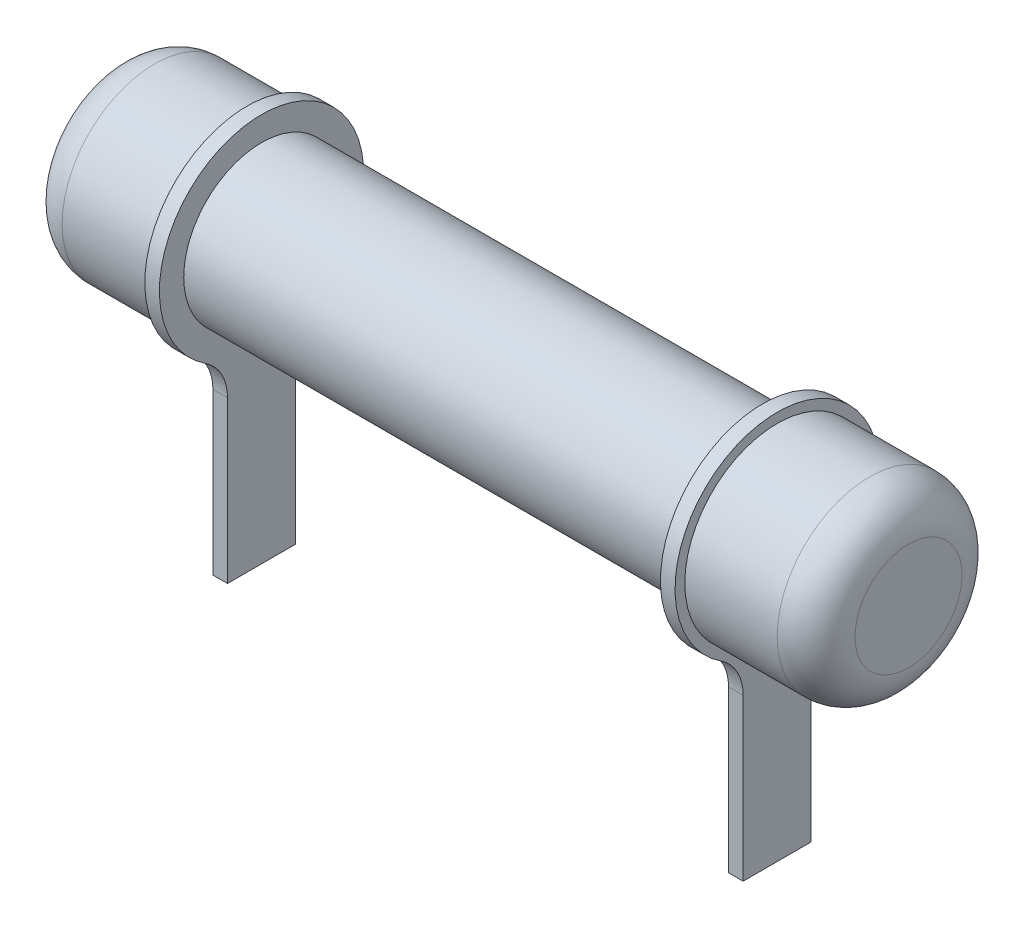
ISO-10303-21;
HEADER;
FILE_DESCRIPTION(('STEP AP214'),'2;1');
FILE_NAME('part.step','',(''),(''),'','','');
FILE_SCHEMA(('AUTOMOTIVE_DESIGN { 1 0 10303 214 1 1 1 1 }'));
ENDSEC;
DATA;
#1=APPLICATION_CONTEXT('core data for automotive mechanical design processes');
#2=APPLICATION_PROTOCOL_DEFINITION('international standard','automotive_design',2000,#1);
#3=PRODUCT_CONTEXT('',#1,'mechanical');
#4=PRODUCT('Part','Part','',(#3));
#5=PRODUCT_RELATED_PRODUCT_CATEGORY('part','',(#4));
#6=PRODUCT_DEFINITION_FORMATION('','',#4);
#7=PRODUCT_DEFINITION_CONTEXT('part definition',#1,'design');
#8=PRODUCT_DEFINITION('design','',#6,#7);
#9=PRODUCT_DEFINITION_SHAPE('','',#8);
#10=(LENGTH_UNIT() NAMED_UNIT(*) SI_UNIT(.MILLI.,.METRE.));
#11=(NAMED_UNIT(*) PLANE_ANGLE_UNIT() SI_UNIT($,.RADIAN.));
#12=(NAMED_UNIT(*) SI_UNIT($,.STERADIAN.) SOLID_ANGLE_UNIT());
#13=UNCERTAINTY_MEASURE_WITH_UNIT(LENGTH_MEASURE(1.E-05),#10,'distance_accuracy_value','');
#14=(GEOMETRIC_REPRESENTATION_CONTEXT(3) GLOBAL_UNCERTAINTY_ASSIGNED_CONTEXT((#13)) GLOBAL_UNIT_ASSIGNED_CONTEXT((#10,
#11,#12)) REPRESENTATION_CONTEXT('',''));
#15=CARTESIAN_POINT('',(0.,0.,0.));
#16=DIRECTION('',(0.,0.,1.));
#17=DIRECTION('',(1.,0.,0.));
#18=AXIS2_PLACEMENT_3D('',#15,#16,#17);
#19=CARTESIAN_POINT('',(13.3,0.,0.));
#20=DIRECTION('',(1.,0.,0.));
#21=DIRECTION('',(0.,0.,1.));
#22=AXIS2_PLACEMENT_3D('',#19,#20,#21);
#23=CYLINDRICAL_SURFACE('',#22,2.1);
#24=CARTESIAN_POINT('',(10.6,0.,0.));
#25=DIRECTION('',(-1.,0.,0.));
#26=DIRECTION('',(0.,0.,1.));
#27=AXIS2_PLACEMENT_3D('',#24,#25,#26);
#28=CIRCLE('',#27,2.1);
#29=CARTESIAN_POINT('',(10.6,-1.75607167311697,1.15161290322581));
#30=VERTEX_POINT('',#29);
#31=CARTESIAN_POINT('',(10.6,-1.75607167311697,-1.15161290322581));
#32=VERTEX_POINT('',#31);
#33=EDGE_CURVE('E185',#30,#32,#28,.T.);
#34=ORIENTED_EDGE('',*,*,#33,.T.);
#35=DIRECTION('',(1.,0.,0.));
#36=VECTOR('',#35,1.);
#37=CARTESIAN_POINT('',(13.3,-1.75607167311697,-1.15161290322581));
#38=LINE('',#37,#36);
#39=CARTESIAN_POINT('',(10.3,-1.75607167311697,-1.15161290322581));
#40=VERTEX_POINT('',#39);
#41=EDGE_CURVE('E245',#32,#40,#38,.F.);
#42=ORIENTED_EDGE('',*,*,#41,.T.);
#43=CARTESIAN_POINT('',(10.3,0.,0.));
#44=DIRECTION('',(-1.,0.,0.));
#45=DIRECTION('',(0.,0.,1.));
#46=AXIS2_PLACEMENT_3D('',#43,#44,#45);
#47=CIRCLE('',#46,2.1);
#48=CARTESIAN_POINT('',(10.3,-1.75607167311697,1.15161290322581));
#49=VERTEX_POINT('',#48);
#50=EDGE_CURVE('E166',#49,#40,#47,.T.);
#51=ORIENTED_EDGE('',*,*,#50,.F.);
#52=DIRECTION('',(1.,0.,0.));
#53=VECTOR('',#52,1.);
#54=CARTESIAN_POINT('',(13.3,-1.75607167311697,1.15161290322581));
#55=LINE('',#54,#53);
#56=EDGE_CURVE('E243',#49,#30,#55,.T.);
#57=ORIENTED_EDGE('',*,*,#56,.T.);
#58=EDGE_LOOP('',(#34,#42,#51,#57));
#59=FACE_BOUND('',#58,.T.);
#60=ADVANCED_FACE('F47',(#59),#23,.T.);
#61=CARTESIAN_POINT('',(5.75,0.,0.));
#62=DIRECTION('',(-1.,0.,0.));
#63=DIRECTION('',(0.,0.,1.));
#64=AXIS2_PLACEMENT_3D('',#61,#62,#63);
#65=CYLINDRICAL_SURFACE('',#64,1.6);
#66=CARTESIAN_POINT('',(0.,0.,0.));
#67=DIRECTION('',(-1.,0.,0.));
#68=DIRECTION('',(0.,0.,1.));
#69=AXIS2_PLACEMENT_3D('',#66,#67,#68);
#70=CIRCLE('',#69,1.6);
#71=CARTESIAN_POINT('',(0.,0.,1.6));
#72=VERTEX_POINT('',#71);
#73=EDGE_CURVE('E197',#72,#72,#70,.T.);
#74=ORIENTED_EDGE('',*,*,#73,.F.);
#75=EDGE_LOOP('',(#74));
#76=FACE_BOUND('',#75,.T.);
#77=CARTESIAN_POINT('',(10.3,0.,0.));
#78=DIRECTION('',(-1.,0.,0.));
#79=DIRECTION('',(0.,0.,1.));
#80=AXIS2_PLACEMENT_3D('',#77,#78,#79);
#81=CIRCLE('',#80,1.6);
#82=CARTESIAN_POINT('',(10.3,0.,1.6));
#83=VERTEX_POINT('',#82);
#84=EDGE_CURVE('E173',#83,#83,#81,.T.);
#85=ORIENTED_EDGE('',*,*,#84,.T.);
#86=EDGE_LOOP('',(#85));
#87=FACE_BOUND('',#86,.T.);
#88=ADVANCED_FACE('F302',(#76,#87),#65,.T.);
#89=CARTESIAN_POINT('',(-3.,0.,0.));
#90=DIRECTION('',(-1.,0.,0.));
#91=DIRECTION('',(0.,0.,1.));
#92=AXIS2_PLACEMENT_3D('',#89,#90,#91);
#93=CYLINDRICAL_SURFACE('',#92,2.1);
#94=CARTESIAN_POINT('',(0.,0.,0.));
#95=DIRECTION('',(-1.,0.,0.));
#96=DIRECTION('',(0.,0.,1.));
#97=AXIS2_PLACEMENT_3D('',#94,#95,#96);
#98=CIRCLE('',#97,2.1);
#99=CARTESIAN_POINT('',(0.,-1.75607167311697,1.15161290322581));
#100=VERTEX_POINT('',#99);
#101=CARTESIAN_POINT('',(0.,-1.75607167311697,-1.15161290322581));
#102=VERTEX_POINT('',#101);
#103=EDGE_CURVE('E215',#100,#102,#98,.T.);
#104=ORIENTED_EDGE('',*,*,#103,.T.);
#105=DIRECTION('',(-1.,0.,0.));
#106=VECTOR('',#105,1.);
#107=CARTESIAN_POINT('',(-3.,-1.75607167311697,-1.15161290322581));
#108=LINE('',#107,#106);
#109=CARTESIAN_POINT('',(-0.3,-1.75607167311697,-1.15161290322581));
#110=VERTEX_POINT('',#109);
#111=EDGE_CURVE('E251',#102,#110,#108,.T.);
#112=ORIENTED_EDGE('',*,*,#111,.T.);
#113=CARTESIAN_POINT('',(-0.3,0.,0.));
#114=DIRECTION('',(-1.,0.,0.));
#115=DIRECTION('',(0.,0.,1.));
#116=AXIS2_PLACEMENT_3D('',#113,#114,#115);
#117=CIRCLE('',#116,2.1);
#118=CARTESIAN_POINT('',(-0.3,-1.75607167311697,1.15161290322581));
#119=VERTEX_POINT('',#118);
#120=EDGE_CURVE('E234',#119,#110,#117,.T.);
#121=ORIENTED_EDGE('',*,*,#120,.F.);
#122=DIRECTION('',(-1.,0.,0.));
#123=VECTOR('',#122,1.);
#124=CARTESIAN_POINT('',(-3.,-1.75607167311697,1.15161290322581));
#125=LINE('',#124,#123);
#126=EDGE_CURVE('E248',#119,#100,#125,.F.);
#127=ORIENTED_EDGE('',*,*,#126,.T.);
#128=EDGE_LOOP('',(#104,#112,#121,#127));
#129=FACE_BOUND('',#128,.T.);
#130=ADVANCED_FACE('F49',(#129),#93,.T.);
#131=CARTESIAN_POINT('',(-0.3,2.1,0.));
#132=DIRECTION('',(1.,0.,0.));
#133=DIRECTION('',(0.,0.,-1.));
#134=AXIS2_PLACEMENT_3D('',#131,#132,#133);
#135=PLANE('',#134);
#136=DIRECTION('',(0.,1.,0.));
#137=VECTOR('',#136,1.);
#138=CARTESIAN_POINT('',(-0.3,-5.9,0.7));
#139=LINE('',#138,#137);
#140=CARTESIAN_POINT('',(-0.3,-5.9,0.7));
#141=VERTEX_POINT('',#140);
#142=CARTESIAN_POINT('',(-0.3,-2.59229627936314,0.7));
#143=VERTEX_POINT('',#142);
#144=EDGE_CURVE('E216',#141,#143,#139,.T.);
#145=ORIENTED_EDGE('',*,*,#144,.T.);
#146=CARTESIAN_POINT('',(-0.3,-2.59229627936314,1.7));
#147=DIRECTION('',(1.,0.,0.));
#148=DIRECTION('',(0.,0.,-1.));
#149=AXIS2_PLACEMENT_3D('',#146,#147,#148);
#150=CIRCLE('',#149,1.);
#151=EDGE_CURVE('E12',#143,#119,#150,.T.);
#152=ORIENTED_EDGE('',*,*,#151,.T.);
#153=ORIENTED_EDGE('',*,*,#120,.T.);
#154=CARTESIAN_POINT('',(-0.3,-2.59229627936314,-1.7));
#155=DIRECTION('',(1.,0.,0.));
#156=DIRECTION('',(0.,0.,-1.));
#157=AXIS2_PLACEMENT_3D('',#154,#155,#156);
#158=CIRCLE('',#157,1.);
#159=CARTESIAN_POINT('',(-0.3,-2.59229627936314,-0.7));
#160=VERTEX_POINT('',#159);
#161=EDGE_CURVE('E265',#110,#160,#158,.T.);
#162=ORIENTED_EDGE('',*,*,#161,.T.);
#163=DIRECTION('',(0.,1.,0.));
#164=VECTOR('',#163,1.);
#165=CARTESIAN_POINT('',(-0.3,-5.9,-0.7));
#166=LINE('',#165,#164);
#167=CARTESIAN_POINT('',(-0.3,-5.9,-0.7));
#168=VERTEX_POINT('',#167);
#169=EDGE_CURVE('E218',#168,#160,#166,.T.);
#170=ORIENTED_EDGE('',*,*,#169,.F.);
#171=DIRECTION('',(0.,0.,1.));
#172=VECTOR('',#171,1.);
#173=CARTESIAN_POINT('',(-0.3,-5.9,0.7));
#174=LINE('',#173,#172);
#175=EDGE_CURVE('E206',#168,#141,#174,.T.);
#176=ORIENTED_EDGE('',*,*,#175,.T.);
#177=EDGE_LOOP('',(#145,#152,#153,#162,#170,#176));
#178=FACE_BOUND('',#177,.T.);
#179=CARTESIAN_POINT('',(-0.3,0.,0.));
#180=DIRECTION('',(-1.,0.,0.));
#181=DIRECTION('',(0.,0.,1.));
#182=AXIS2_PLACEMENT_3D('',#179,#180,#181);
#183=CIRCLE('',#182,1.9);
#184=CARTESIAN_POINT('',(-0.3,0.,1.9));
#185=VERTEX_POINT('',#184);
#186=EDGE_CURVE('E231',#185,#185,#183,.T.);
#187=ORIENTED_EDGE('',*,*,#186,.F.);
#188=EDGE_LOOP('',(#187));
#189=FACE_BOUND('',#188,.T.);
#190=ADVANCED_FACE('F279',(#178,#189),#135,.F.);
#191=CARTESIAN_POINT('',(-3.,0.,0.));
#192=DIRECTION('',(-1.,0.,0.));
#193=DIRECTION('',(0.,0.,1.));
#194=AXIS2_PLACEMENT_3D('',#191,#192,#193);
#195=CYLINDRICAL_SURFACE('',#194,1.9);
#196=CARTESIAN_POINT('',(-2.2,0.,0.));
#197=DIRECTION('',(-1.,0.,0.));
#198=DIRECTION('',(0.,0.,1.));
#199=AXIS2_PLACEMENT_3D('',#196,#197,#198);
#200=CIRCLE('',#199,1.9);
#201=CARTESIAN_POINT('',(-2.2,0.,1.9));
#202=VERTEX_POINT('',#201);
#203=EDGE_CURVE('E228',#202,#202,#200,.T.);
#204=ORIENTED_EDGE('',*,*,#203,.F.);
#205=EDGE_LOOP('',(#204));
#206=FACE_BOUND('',#205,.T.);
#207=ORIENTED_EDGE('',*,*,#186,.T.);
#208=EDGE_LOOP('',(#207));
#209=FACE_BOUND('',#208,.T.);
#210=ADVANCED_FACE('F342',(#206,#209),#195,.T.);
#211=CARTESIAN_POINT('',(-2.2,0.,0.));
#212=DIRECTION('',(-1.,0.,0.));
#213=DIRECTION('',(0.,0.,1.));
#214=AXIS2_PLACEMENT_3D('',#211,#212,#213);
#215=TOROIDAL_SURFACE('',#214,1.1,0.8);
#216=CARTESIAN_POINT('',(-3.,0.,0.));
#217=DIRECTION('',(-1.,0.,0.));
#218=DIRECTION('',(0.,0.,1.));
#219=AXIS2_PLACEMENT_3D('',#216,#217,#218);
#220=CIRCLE('',#219,1.1);
#221=CARTESIAN_POINT('',(-3.,0.,1.1));
#222=VERTEX_POINT('',#221);
#223=EDGE_CURVE('E225',#222,#222,#220,.T.);
#224=ORIENTED_EDGE('',*,*,#223,.F.);
#225=EDGE_LOOP('',(#224));
#226=FACE_BOUND('',#225,.T.);
#227=ORIENTED_EDGE('',*,*,#203,.T.);
#228=EDGE_LOOP('',(#227));
#229=FACE_BOUND('',#228,.T.);
#230=ADVANCED_FACE('F338',(#226,#229),#215,.T.);
#231=CARTESIAN_POINT('',(-3.,1.1,0.));
#232=DIRECTION('',(1.,0.,0.));
#233=DIRECTION('',(0.,0.,-1.));
#234=AXIS2_PLACEMENT_3D('',#231,#232,#233);
#235=PLANE('',#234);
#236=ORIENTED_EDGE('',*,*,#223,.T.);
#237=EDGE_LOOP('',(#236));
#238=FACE_BOUND('',#237,.T.);
#239=ADVANCED_FACE('F332',(#238),#235,.F.);
#240=CARTESIAN_POINT('',(0.,1.6,0.));
#241=DIRECTION('',(-1.,0.,0.));
#242=DIRECTION('',(0.,0.,1.));
#243=AXIS2_PLACEMENT_3D('',#240,#241,#242);
#244=PLANE('',#243);
#245=ORIENTED_EDGE('',*,*,#103,.F.);
#246=CARTESIAN_POINT('',(0.,-2.59229627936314,1.7));
#247=DIRECTION('',(-1.,0.,0.));
#248=DIRECTION('',(0.,0.,1.));
#249=AXIS2_PLACEMENT_3D('',#246,#247,#248);
#250=CIRCLE('',#249,1.);
#251=CARTESIAN_POINT('',(0.,-2.59229627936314,0.7));
#252=VERTEX_POINT('',#251);
#253=EDGE_CURVE('E56',#100,#252,#250,.T.);
#254=ORIENTED_EDGE('',*,*,#253,.T.);
#255=DIRECTION('',(0.,1.,0.));
#256=VECTOR('',#255,1.);
#257=CARTESIAN_POINT('',(0.,-5.9,0.7));
#258=LINE('',#257,#256);
#259=CARTESIAN_POINT('',(0.,-5.9,0.7));
#260=VERTEX_POINT('',#259);
#261=EDGE_CURVE('E213',#260,#252,#258,.T.);
#262=ORIENTED_EDGE('',*,*,#261,.F.);
#263=DIRECTION('',(0.,0.,-1.));
#264=VECTOR('',#263,1.);
#265=CARTESIAN_POINT('',(0.,-5.9,0.7));
#266=LINE('',#265,#264);
#267=CARTESIAN_POINT('',(0.,-5.9,-0.7));
#268=VERTEX_POINT('',#267);
#269=EDGE_CURVE('E200',#260,#268,#266,.T.);
#270=ORIENTED_EDGE('',*,*,#269,.T.);
#271=DIRECTION('',(0.,1.,0.));
#272=VECTOR('',#271,1.);
#273=CARTESIAN_POINT('',(0.,-5.9,-0.7));
#274=LINE('',#273,#272);
#275=CARTESIAN_POINT('',(0.,-2.59229627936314,-0.7));
#276=VERTEX_POINT('',#275);
#277=EDGE_CURVE('E212',#268,#276,#274,.T.);
#278=ORIENTED_EDGE('',*,*,#277,.T.);
#279=CARTESIAN_POINT('',(0.,-2.59229627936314,-1.7));
#280=DIRECTION('',(-1.,0.,0.));
#281=DIRECTION('',(0.,0.,1.));
#282=AXIS2_PLACEMENT_3D('',#279,#280,#281);
#283=CIRCLE('',#282,1.);
#284=EDGE_CURVE('E267',#276,#102,#283,.T.);
#285=ORIENTED_EDGE('',*,*,#284,.T.);
#286=EDGE_LOOP('',(#245,#254,#262,#270,#278,#285));
#287=FACE_BOUND('',#286,.T.);
#288=ORIENTED_EDGE('',*,*,#73,.T.);
#289=EDGE_LOOP('',(#288));
#290=FACE_BOUND('',#289,.T.);
#291=ADVANCED_FACE('F269',(#287,#290),#244,.F.);
#292=CARTESIAN_POINT('',(0.,-5.9,0.7));
#293=DIRECTION('',(0.,0.,1.));
#294=DIRECTION('',(1.,0.,0.));
#295=AXIS2_PLACEMENT_3D('',#292,#293,#294);
#296=PLANE('',#295);
#297=ORIENTED_EDGE('',*,*,#261,.T.);
#298=DIRECTION('',(-1.,0.,0.));
#299=VECTOR('',#298,1.);
#300=CARTESIAN_POINT('',(0.,-2.59229627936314,0.7));
#301=LINE('',#300,#299);
#302=EDGE_CURVE('E69',#252,#143,#301,.T.);
#303=ORIENTED_EDGE('',*,*,#302,.T.);
#304=ORIENTED_EDGE('',*,*,#144,.F.);
#305=DIRECTION('',(1.,0.,0.));
#306=VECTOR('',#305,1.);
#307=CARTESIAN_POINT('',(0.,-5.9,0.7));
#308=LINE('',#307,#306);
#309=EDGE_CURVE('E209',#141,#260,#308,.T.);
#310=ORIENTED_EDGE('',*,*,#309,.T.);
#311=EDGE_LOOP('',(#297,#303,#304,#310));
#312=FACE_BOUND('',#311,.T.);
#313=ADVANCED_FACE('F289',(#312),#296,.T.);
#314=CARTESIAN_POINT('',(0.,-5.9,-0.7));
#315=DIRECTION('',(0.,0.,-1.));
#316=DIRECTION('',(-1.,0.,0.));
#317=AXIS2_PLACEMENT_3D('',#314,#315,#316);
#318=PLANE('',#317);
#319=ORIENTED_EDGE('',*,*,#169,.T.);
#320=DIRECTION('',(-1.,0.,0.));
#321=VECTOR('',#320,1.);
#322=CARTESIAN_POINT('',(0.,-2.59229627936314,-0.7));
#323=LINE('',#322,#321);
#324=EDGE_CURVE('E254',#160,#276,#323,.F.);
#325=ORIENTED_EDGE('',*,*,#324,.T.);
#326=ORIENTED_EDGE('',*,*,#277,.F.);
#327=DIRECTION('',(-1.,0.,0.));
#328=VECTOR('',#327,1.);
#329=CARTESIAN_POINT('',(0.,-5.9,-0.7));
#330=LINE('',#329,#328);
#331=EDGE_CURVE('E203',#268,#168,#330,.T.);
#332=ORIENTED_EDGE('',*,*,#331,.T.);
#333=EDGE_LOOP('',(#319,#325,#326,#332));
#334=FACE_BOUND('',#333,.T.);
#335=ADVANCED_FACE('F283',(#334),#318,.T.);
#336=CARTESIAN_POINT('',(0.,-5.9,-0.7));
#337=DIRECTION('',(0.,1.,0.));
#338=DIRECTION('',(0.,0.,1.));
#339=AXIS2_PLACEMENT_3D('',#336,#337,#338);
#340=PLANE('',#339);
#341=ORIENTED_EDGE('',*,*,#269,.F.);
#342=ORIENTED_EDGE('',*,*,#309,.F.);
#343=ORIENTED_EDGE('',*,*,#175,.F.);
#344=ORIENTED_EDGE('',*,*,#331,.F.);
#345=EDGE_LOOP('',(#341,#342,#343,#344));
#346=FACE_BOUND('',#345,.T.);
#347=ADVANCED_FACE('F287',(#346),#340,.F.);
#348=CARTESIAN_POINT('',(10.6,2.1,0.));
#349=DIRECTION('',(-1.,0.,0.));
#350=DIRECTION('',(0.,0.,-1.));
#351=AXIS2_PLACEMENT_3D('',#348,#349,#350);
#352=PLANE('',#351);
#353=ORIENTED_EDGE('',*,*,#33,.F.);
#354=CARTESIAN_POINT('',(10.6,-2.59229627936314,1.7));
#355=DIRECTION('',(-1.,0.,0.));
#356=DIRECTION('',(0.,0.,1.));
#357=AXIS2_PLACEMENT_3D('',#354,#355,#356);
#358=CIRCLE('',#357,1.);
#359=CARTESIAN_POINT('',(10.6,-2.59229627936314,0.7));
#360=VERTEX_POINT('',#359);
#361=EDGE_CURVE('E263',#30,#360,#358,.T.);
#362=ORIENTED_EDGE('',*,*,#361,.T.);
#363=DIRECTION('',(0.,1.,0.));
#364=VECTOR('',#363,1.);
#365=CARTESIAN_POINT('',(10.6,-5.9,0.7));
#366=LINE('',#365,#364);
#367=CARTESIAN_POINT('',(10.6,-5.9,0.7));
#368=VERTEX_POINT('',#367);
#369=EDGE_CURVE('E154',#368,#360,#366,.T.);
#370=ORIENTED_EDGE('',*,*,#369,.F.);
#371=DIRECTION('',(0.,0.,1.));
#372=VECTOR('',#371,1.);
#373=CARTESIAN_POINT('',(10.6,-5.9,0.7));
#374=LINE('',#373,#372);
#375=CARTESIAN_POINT('',(10.6,-5.9,-0.7));
#376=VERTEX_POINT('',#375);
#377=EDGE_CURVE('E142',#376,#368,#374,.T.);
#378=ORIENTED_EDGE('',*,*,#377,.F.);
#379=DIRECTION('',(0.,1.,0.));
#380=VECTOR('',#379,1.);
#381=CARTESIAN_POINT('',(10.6,-5.9,-0.7));
#382=LINE('',#381,#380);
#383=CARTESIAN_POINT('',(10.6,-2.59229627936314,-0.7));
#384=VERTEX_POINT('',#383);
#385=EDGE_CURVE('E167',#376,#384,#382,.T.);
#386=ORIENTED_EDGE('',*,*,#385,.T.);
#387=CARTESIAN_POINT('',(10.6,-2.59229627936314,-1.7));
#388=DIRECTION('',(-1.,0.,0.));
#389=DIRECTION('',(0.,0.,1.));
#390=AXIS2_PLACEMENT_3D('',#387,#388,#389);
#391=CIRCLE('',#390,1.);
#392=EDGE_CURVE('E257',#384,#32,#391,.T.);
#393=ORIENTED_EDGE('',*,*,#392,.T.);
#394=EDGE_LOOP('',(#353,#362,#370,#378,#386,#393));
#395=FACE_BOUND('',#394,.T.);
#396=CARTESIAN_POINT('',(10.6,0.,0.));
#397=DIRECTION('',(-1.,0.,0.));
#398=DIRECTION('',(0.,0.,1.));
#399=AXIS2_PLACEMENT_3D('',#396,#397,#398);
#400=CIRCLE('',#399,1.9);
#401=CARTESIAN_POINT('',(10.6,0.,1.9));
#402=VERTEX_POINT('',#401);
#403=EDGE_CURVE('E182',#402,#402,#400,.T.);
#404=ORIENTED_EDGE('',*,*,#403,.T.);
#405=EDGE_LOOP('',(#404));
#406=FACE_BOUND('',#405,.T.);
#407=ADVANCED_FACE('F312',(#395,#406),#352,.F.);
#408=CARTESIAN_POINT('',(13.3,0.,0.));
#409=DIRECTION('',(1.,0.,0.));
#410=DIRECTION('',(0.,0.,1.));
#411=AXIS2_PLACEMENT_3D('',#408,#409,#410);
#412=CYLINDRICAL_SURFACE('',#411,1.9);
#413=CARTESIAN_POINT('',(12.5,0.,0.));
#414=DIRECTION('',(-1.,0.,0.));
#415=DIRECTION('',(0.,0.,1.));
#416=AXIS2_PLACEMENT_3D('',#413,#414,#415);
#417=CIRCLE('',#416,1.9);
#418=CARTESIAN_POINT('',(12.5,0.,1.9));
#419=VERTEX_POINT('',#418);
#420=EDGE_CURVE('E179',#419,#419,#417,.T.);
#421=ORIENTED_EDGE('',*,*,#420,.T.);
#422=EDGE_LOOP('',(#421));
#423=FACE_BOUND('',#422,.T.);
#424=ORIENTED_EDGE('',*,*,#403,.F.);
#425=EDGE_LOOP('',(#424));
#426=FACE_BOUND('',#425,.T.);
#427=ADVANCED_FACE('F401',(#423,#426),#412,.T.);
#428=CARTESIAN_POINT('',(12.5,0.,0.));
#429=DIRECTION('',(1.,0.,0.));
#430=DIRECTION('',(0.,0.,1.));
#431=AXIS2_PLACEMENT_3D('',#428,#429,#430);
#432=TOROIDAL_SURFACE('',#431,1.1,0.8);
#433=CARTESIAN_POINT('',(13.3,0.,0.));
#434=DIRECTION('',(-1.,0.,0.));
#435=DIRECTION('',(0.,0.,1.));
#436=AXIS2_PLACEMENT_3D('',#433,#434,#435);
#437=CIRCLE('',#436,1.1);
#438=CARTESIAN_POINT('',(13.3,0.,1.1));
#439=VERTEX_POINT('',#438);
#440=EDGE_CURVE('E176',#439,#439,#437,.T.);
#441=ORIENTED_EDGE('',*,*,#440,.T.);
#442=EDGE_LOOP('',(#441));
#443=FACE_BOUND('',#442,.T.);
#444=ORIENTED_EDGE('',*,*,#420,.F.);
#445=EDGE_LOOP('',(#444));
#446=FACE_BOUND('',#445,.T.);
#447=ADVANCED_FACE('F473',(#443,#446),#432,.T.);
#448=CARTESIAN_POINT('',(13.3,1.1,0.));
#449=DIRECTION('',(-1.,0.,0.));
#450=DIRECTION('',(0.,0.,-1.));
#451=AXIS2_PLACEMENT_3D('',#448,#449,#450);
#452=PLANE('',#451);
#453=ORIENTED_EDGE('',*,*,#440,.F.);
#454=EDGE_LOOP('',(#453));
#455=FACE_BOUND('',#454,.T.);
#456=ADVANCED_FACE('F414',(#455),#452,.F.);
#457=CARTESIAN_POINT('',(10.3,1.6,0.));
#458=DIRECTION('',(1.,0.,0.));
#459=DIRECTION('',(0.,0.,1.));
#460=AXIS2_PLACEMENT_3D('',#457,#458,#459);
#461=PLANE('',#460);
#462=DIRECTION('',(0.,1.,0.));
#463=VECTOR('',#462,1.);
#464=CARTESIAN_POINT('',(10.3,-5.9,0.7));
#465=LINE('',#464,#463);
#466=CARTESIAN_POINT('',(10.3,-5.9,0.7));
#467=VERTEX_POINT('',#466);
#468=CARTESIAN_POINT('',(10.3,-2.59229627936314,0.7));
#469=VERTEX_POINT('',#468);
#470=EDGE_CURVE('E149',#467,#469,#465,.T.);
#471=ORIENTED_EDGE('',*,*,#470,.T.);
#472=CARTESIAN_POINT('',(10.3,-2.59229627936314,1.7));
#473=DIRECTION('',(1.,0.,0.));
#474=DIRECTION('',(0.,0.,-1.));
#475=AXIS2_PLACEMENT_3D('',#472,#473,#474);
#476=CIRCLE('',#475,1.);
#477=EDGE_CURVE('E261',#469,#49,#476,.T.);
#478=ORIENTED_EDGE('',*,*,#477,.T.);
#479=ORIENTED_EDGE('',*,*,#50,.T.);
#480=CARTESIAN_POINT('',(10.3,-2.59229627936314,-1.7));
#481=DIRECTION('',(1.,0.,0.));
#482=DIRECTION('',(0.,0.,-1.));
#483=AXIS2_PLACEMENT_3D('',#480,#481,#482);
#484=CIRCLE('',#483,1.);
#485=CARTESIAN_POINT('',(10.3,-2.59229627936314,-0.7));
#486=VERTEX_POINT('',#485);
#487=EDGE_CURVE('E259',#40,#486,#484,.T.);
#488=ORIENTED_EDGE('',*,*,#487,.T.);
#489=DIRECTION('',(0.,1.,0.));
#490=VECTOR('',#489,1.);
#491=CARTESIAN_POINT('',(10.3,-5.9,-0.7));
#492=LINE('',#491,#490);
#493=CARTESIAN_POINT('',(10.3,-5.9,-0.7));
#494=VERTEX_POINT('',#493);
#495=EDGE_CURVE('E160',#494,#486,#492,.T.);
#496=ORIENTED_EDGE('',*,*,#495,.F.);
#497=DIRECTION('',(0.,0.,-1.));
#498=VECTOR('',#497,1.);
#499=CARTESIAN_POINT('',(10.3,-5.9,0.7));
#500=LINE('',#499,#498);
#501=EDGE_CURVE('E139',#467,#494,#500,.T.);
#502=ORIENTED_EDGE('',*,*,#501,.F.);
#503=EDGE_LOOP('',(#471,#478,#479,#488,#496,#502));
#504=FACE_BOUND('',#503,.T.);
#505=ORIENTED_EDGE('',*,*,#84,.F.);
#506=EDGE_LOOP('',(#505));
#507=FACE_BOUND('',#506,.T.);
#508=ADVANCED_FACE('F157',(#504,#507),#461,.F.);
#509=CARTESIAN_POINT('',(10.3,-5.9,-0.7));
#510=DIRECTION('',(0.,0.,1.));
#511=DIRECTION('',(1.,0.,0.));
#512=AXIS2_PLACEMENT_3D('',#509,#510,#511);
#513=PLANE('',#512);
#514=ORIENTED_EDGE('',*,*,#495,.T.);
#515=DIRECTION('',(-1.,0.,0.));
#516=VECTOR('',#515,1.);
#517=CARTESIAN_POINT('',(10.6,-2.59229627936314,-0.7));
#518=LINE('',#517,#516);
#519=EDGE_CURVE('E240',#486,#384,#518,.F.);
#520=ORIENTED_EDGE('',*,*,#519,.T.);
#521=ORIENTED_EDGE('',*,*,#385,.F.);
#522=DIRECTION('',(1.,0.,0.));
#523=VECTOR('',#522,1.);
#524=CARTESIAN_POINT('',(10.3,-5.9,-0.7));
#525=LINE('',#524,#523);
#526=EDGE_CURVE('E155',#494,#376,#525,.T.);
#527=ORIENTED_EDGE('',*,*,#526,.F.);
#528=EDGE_LOOP('',(#514,#520,#521,#527));
#529=FACE_BOUND('',#528,.T.);
#530=ADVANCED_FACE('F413',(#529),#513,.F.);
#531=CARTESIAN_POINT('',(10.3,-5.9,0.7));
#532=DIRECTION('',(0.,0.,-1.));
#533=DIRECTION('',(-1.,0.,0.));
#534=AXIS2_PLACEMENT_3D('',#531,#532,#533);
#535=PLANE('',#534);
#536=ORIENTED_EDGE('',*,*,#369,.T.);
#537=DIRECTION('',(-1.,0.,0.));
#538=VECTOR('',#537,1.);
#539=CARTESIAN_POINT('',(10.3,-2.59229627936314,0.7));
#540=LINE('',#539,#538);
#541=EDGE_CURVE('E152',#360,#469,#540,.T.);
#542=ORIENTED_EDGE('',*,*,#541,.T.);
#543=ORIENTED_EDGE('',*,*,#470,.F.);
#544=DIRECTION('',(-1.,0.,0.));
#545=VECTOR('',#544,1.);
#546=CARTESIAN_POINT('',(10.3,-5.9,0.7));
#547=LINE('',#546,#545);
#548=EDGE_CURVE('E135',#368,#467,#547,.T.);
#549=ORIENTED_EDGE('',*,*,#548,.F.);
#550=EDGE_LOOP('',(#536,#542,#543,#549));
#551=FACE_BOUND('',#550,.T.);
#552=ADVANCED_FACE('F150',(#551),#535,.F.);
#553=CARTESIAN_POINT('',(10.3,-5.9,-0.7));
#554=DIRECTION('',(0.,1.,0.));
#555=DIRECTION('',(0.,0.,1.));
#556=AXIS2_PLACEMENT_3D('',#553,#554,#555);
#557=PLANE('',#556);
#558=ORIENTED_EDGE('',*,*,#501,.T.);
#559=ORIENTED_EDGE('',*,*,#526,.T.);
#560=ORIENTED_EDGE('',*,*,#377,.T.);
#561=ORIENTED_EDGE('',*,*,#548,.T.);
#562=EDGE_LOOP('',(#558,#559,#560,#561));
#563=FACE_BOUND('',#562,.T.);
#564=ADVANCED_FACE('F137',(#563),#557,.F.);
#565=CARTESIAN_POINT('',(13.3,-2.59229627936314,-1.7));
#566=DIRECTION('',(1.,0.,0.));
#567=DIRECTION('',(0.,0.,-1.));
#568=AXIS2_PLACEMENT_3D('',#565,#566,#567);
#569=CYLINDRICAL_SURFACE('',#568,1.);
#570=ORIENTED_EDGE('',*,*,#487,.F.);
#571=ORIENTED_EDGE('',*,*,#41,.F.);
#572=ORIENTED_EDGE('',*,*,#392,.F.);
#573=ORIENTED_EDGE('',*,*,#519,.F.);
#574=EDGE_LOOP('',(#570,#571,#572,#573));
#575=FACE_BOUND('',#574,.T.);
#576=ADVANCED_FACE('F438',(#575),#569,.F.);
#577=CARTESIAN_POINT('',(13.3,-2.59229627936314,1.7));
#578=DIRECTION('',(1.,0.,0.));
#579=DIRECTION('',(0.,0.,-1.));
#580=AXIS2_PLACEMENT_3D('',#577,#578,#579);
#581=CYLINDRICAL_SURFACE('',#580,1.);
#582=ORIENTED_EDGE('',*,*,#361,.F.);
#583=ORIENTED_EDGE('',*,*,#56,.F.);
#584=ORIENTED_EDGE('',*,*,#477,.F.);
#585=ORIENTED_EDGE('',*,*,#541,.F.);
#586=EDGE_LOOP('',(#582,#583,#584,#585));
#587=FACE_BOUND('',#586,.T.);
#588=ADVANCED_FACE('F299',(#587),#581,.F.);
#589=CARTESIAN_POINT('',(-3.,-2.59229627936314,-1.7));
#590=DIRECTION('',(-1.,0.,0.));
#591=DIRECTION('',(0.,0.,1.));
#592=AXIS2_PLACEMENT_3D('',#589,#590,#591);
#593=CYLINDRICAL_SURFACE('',#592,1.);
#594=ORIENTED_EDGE('',*,*,#284,.F.);
#595=ORIENTED_EDGE('',*,*,#324,.F.);
#596=ORIENTED_EDGE('',*,*,#161,.F.);
#597=ORIENTED_EDGE('',*,*,#111,.F.);
#598=EDGE_LOOP('',(#594,#595,#596,#597));
#599=FACE_BOUND('',#598,.T.);
#600=ADVANCED_FACE('F277',(#599),#593,.F.);
#601=CARTESIAN_POINT('',(-3.,-2.59229627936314,1.7));
#602=DIRECTION('',(-1.,0.,0.));
#603=DIRECTION('',(0.,0.,1.));
#604=AXIS2_PLACEMENT_3D('',#601,#602,#603);
#605=CYLINDRICAL_SURFACE('',#604,1.);
#606=ORIENTED_EDGE('',*,*,#151,.F.);
#607=ORIENTED_EDGE('',*,*,#302,.F.);
#608=ORIENTED_EDGE('',*,*,#253,.F.);
#609=ORIENTED_EDGE('',*,*,#126,.F.);
#610=EDGE_LOOP('',(#606,#607,#608,#609));
#611=FACE_BOUND('',#610,.T.);
#612=ADVANCED_FACE('F292',(#611),#605,.F.);
#613=CLOSED_SHELL('',(#60,#88,#130,#190,#210,#230,#239,#291,#313,#335,#347,#407,#427,#447,#456,
#508,#530,#552,#564,#576,#588,#600,#612));
#614=CARTESIAN_POINT('',(5.75,0.,0.));
#615=DIRECTION('',(-1.,0.,0.));
#616=DIRECTION('',(0.,0.,1.));
#617=AXIS2_PLACEMENT_3D('',#614,#615,#616);
#618=CYLINDRICAL_SURFACE('',#617,0.15);
#619=CARTESIAN_POINT('',(-2.,0.,0.));
#620=DIRECTION('',(-1.,0.,0.));
#621=DIRECTION('',(0.,0.,1.));
#622=AXIS2_PLACEMENT_3D('',#619,#620,#621);
#623=CIRCLE('',#622,0.15);
#624=CARTESIAN_POINT('',(-2.,0.,0.15));
#625=VERTEX_POINT('',#624);
#626=EDGE_CURVE('E237',#625,#625,#623,.F.);
#627=ORIENTED_EDGE('',*,*,#626,.T.);
#628=EDGE_LOOP('',(#627));
#629=FACE_BOUND('',#628,.T.);
#630=CARTESIAN_POINT('',(12.3,0.,0.));
#631=DIRECTION('',(1.,0.,0.));
#632=DIRECTION('',(0.,0.,-1.));
#633=AXIS2_PLACEMENT_3D('',#630,#631,#632);
#634=CIRCLE('',#633,0.15);
#635=CARTESIAN_POINT('',(12.3,0.,-0.15));
#636=VERTEX_POINT('',#635);
#637=EDGE_CURVE('E191',#636,#636,#634,.T.);
#638=ORIENTED_EDGE('',*,*,#637,.F.);
#639=EDGE_LOOP('',(#638));
#640=FACE_BOUND('',#639,.T.);
#641=ADVANCED_FACE('F314',(#629,#640),#618,.T.);
#642=CARTESIAN_POINT('',(-2.,1.6,0.));
#643=DIRECTION('',(-1.,0.,0.));
#644=DIRECTION('',(0.,0.,1.));
#645=AXIS2_PLACEMENT_3D('',#642,#643,#644);
#646=PLANE('',#645);
#647=CARTESIAN_POINT('',(-2.,0.,0.));
#648=DIRECTION('',(1.,0.,0.));
#649=DIRECTION('',(0.,0.,-1.));
#650=AXIS2_PLACEMENT_3D('',#647,#648,#649);
#651=CIRCLE('',#650,1.3);
#652=CARTESIAN_POINT('',(-2.,0.,-1.3));
#653=VERTEX_POINT('',#652);
#654=EDGE_CURVE('E194',#653,#653,#651,.T.);
#655=ORIENTED_EDGE('',*,*,#654,.T.);
#656=EDGE_LOOP('',(#655));
#657=FACE_BOUND('',#656,.T.);
#658=ORIENTED_EDGE('',*,*,#626,.F.);
#659=EDGE_LOOP('',(#658));
#660=FACE_BOUND('',#659,.T.);
#661=ADVANCED_FACE('F315',(#657,#660),#646,.F.);
#662=CARTESIAN_POINT('',(5.75,0.,0.));
#663=DIRECTION('',(-1.,0.,0.));
#664=DIRECTION('',(0.,0.,1.));
#665=AXIS2_PLACEMENT_3D('',#662,#663,#664);
#666=CYLINDRICAL_SURFACE('',#665,1.3);
#667=ORIENTED_EDGE('',*,*,#654,.F.);
#668=EDGE_LOOP('',(#667));
#669=FACE_BOUND('',#668,.T.);
#670=CARTESIAN_POINT('',(12.3,0.,0.));
#671=DIRECTION('',(1.,0.,0.));
#672=DIRECTION('',(0.,0.,-1.));
#673=AXIS2_PLACEMENT_3D('',#670,#671,#672);
#674=CIRCLE('',#673,1.3);
#675=CARTESIAN_POINT('',(12.3,0.,-1.3));
#676=VERTEX_POINT('',#675);
#677=EDGE_CURVE('E188',#676,#676,#674,.T.);
#678=ORIENTED_EDGE('',*,*,#677,.T.);
#679=EDGE_LOOP('',(#678));
#680=FACE_BOUND('',#679,.T.);
#681=ADVANCED_FACE('F319',(#669,#680),#666,.F.);
#682=CARTESIAN_POINT('',(12.3,1.6,0.));
#683=DIRECTION('',(1.,0.,0.));
#684=DIRECTION('',(0.,0.,1.));
#685=AXIS2_PLACEMENT_3D('',#682,#683,#684);
#686=PLANE('',#685);
#687=ORIENTED_EDGE('',*,*,#677,.F.);
#688=EDGE_LOOP('',(#687));
#689=FACE_BOUND('',#688,.T.);
#690=ORIENTED_EDGE('',*,*,#637,.T.);
#691=EDGE_LOOP('',(#690));
#692=FACE_BOUND('',#691,.T.);
#693=ADVANCED_FACE('F322',(#689,#692),#686,.F.);
#694=CLOSED_SHELL('',(#641,#661,#681,#693));
#695=ORIENTED_CLOSED_SHELL('',*,#694,.T.);
#696=BREP_WITH_VOIDS('B2',#613,(#695));
#697=ADVANCED_BREP_SHAPE_REPRESENTATION('',(#18,#696),#14);
#698=SHAPE_DEFINITION_REPRESENTATION(#9,#697);
ENDSEC;
END-ISO-10303-21;
